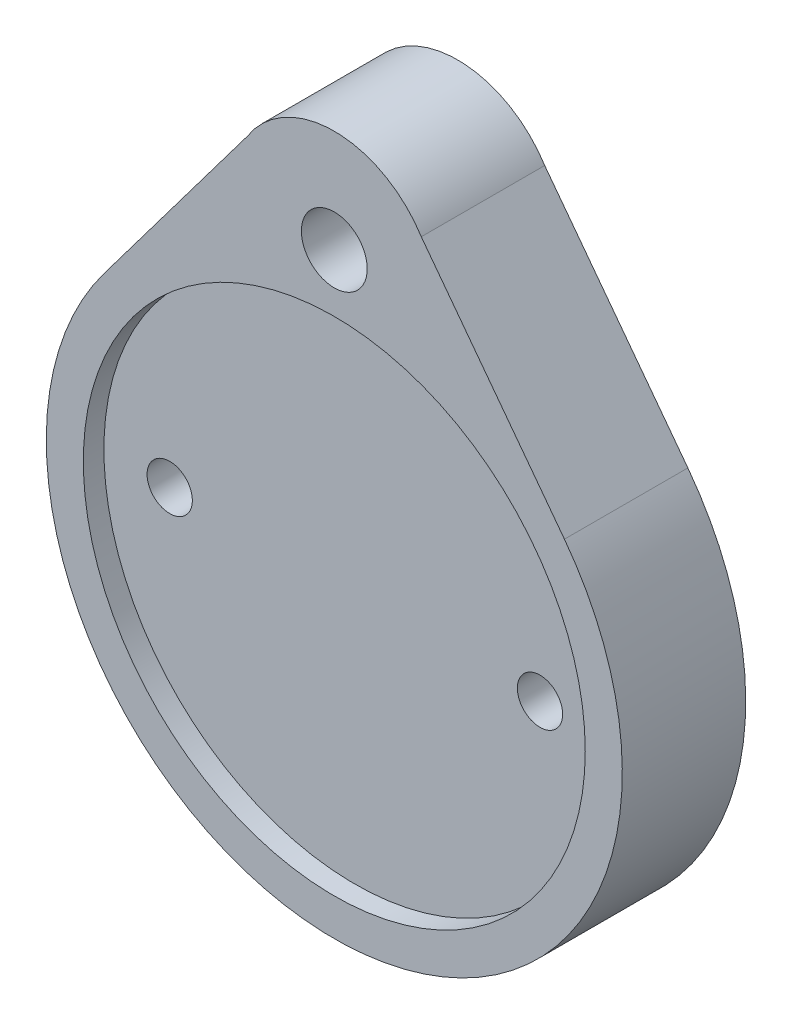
ISO-10303-21;
HEADER;
FILE_DESCRIPTION(('STEP AP214'),'2;1');
FILE_NAME('part.step','',(''),(''),'','','');
FILE_SCHEMA(('AUTOMOTIVE_DESIGN { 1 0 10303 214 1 1 1 1 }'));
ENDSEC;
DATA;
#1=APPLICATION_CONTEXT('core data for automotive mechanical design processes');
#2=APPLICATION_PROTOCOL_DEFINITION('international standard','automotive_design',2000,#1);
#3=PRODUCT_CONTEXT('',#1,'mechanical');
#4=PRODUCT('Part','Part','',(#3));
#5=PRODUCT_RELATED_PRODUCT_CATEGORY('part','',(#4));
#6=PRODUCT_DEFINITION_FORMATION('','',#4);
#7=PRODUCT_DEFINITION_CONTEXT('part definition',#1,'design');
#8=PRODUCT_DEFINITION('design','',#6,#7);
#9=PRODUCT_DEFINITION_SHAPE('','',#8);
#10=(LENGTH_UNIT() NAMED_UNIT(*) SI_UNIT(.MILLI.,.METRE.));
#11=(NAMED_UNIT(*) PLANE_ANGLE_UNIT() SI_UNIT($,.RADIAN.));
#12=(NAMED_UNIT(*) SI_UNIT($,.STERADIAN.) SOLID_ANGLE_UNIT());
#13=UNCERTAINTY_MEASURE_WITH_UNIT(LENGTH_MEASURE(1.E-05),#10,'distance_accuracy_value','');
#14=(GEOMETRIC_REPRESENTATION_CONTEXT(3) GLOBAL_UNCERTAINTY_ASSIGNED_CONTEXT((#13)) GLOBAL_UNIT_ASSIGNED_CONTEXT((#10,
#11,#12)) REPRESENTATION_CONTEXT('',''));
#15=CARTESIAN_POINT('',(0.,0.,0.));
#16=DIRECTION('',(0.,0.,1.));
#17=DIRECTION('',(1.,0.,0.));
#18=AXIS2_PLACEMENT_3D('',#15,#16,#17);
#19=CARTESIAN_POINT('',(0.,15.,6.));
#20=DIRECTION('',(0.,0.,1.));
#21=DIRECTION('',(1.,0.,0.));
#22=AXIS2_PLACEMENT_3D('',#19,#20,#21);
#23=PLANE('',#22);
#24=CARTESIAN_POINT('',(0.,0.,6.));
#25=DIRECTION('',(0.,0.,1.));
#26=DIRECTION('',(1.,0.,0.));
#27=AXIS2_PLACEMENT_3D('',#24,#25,#26);
#28=CIRCLE('',#27,12.2);
#29=CARTESIAN_POINT('',(12.2,0.,6.));
#30=VERTEX_POINT('',#29);
#31=EDGE_CURVE('E122',#30,#30,#28,.T.);
#32=ORIENTED_EDGE('',*,*,#31,.F.);
#33=EDGE_LOOP('',(#32));
#34=FACE_BOUND('',#33,.T.);
#35=CARTESIAN_POINT('',(0.,15.,6.));
#36=DIRECTION('',(0.,0.,1.));
#37=DIRECTION('',(1.,0.,0.));
#38=AXIS2_PLACEMENT_3D('',#35,#36,#37);
#39=CIRCLE('',#38,5.);
#40=CARTESIAN_POINT('',(4.2295258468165,17.6666666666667,6.));
#41=VERTEX_POINT('',#40);
#42=CARTESIAN_POINT('',(-4.2295258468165,17.6666666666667,6.));
#43=VERTEX_POINT('',#42);
#44=EDGE_CURVE('E89',#41,#43,#39,.T.);
#45=ORIENTED_EDGE('',*,*,#44,.T.);
#46=DIRECTION('',(-0.601130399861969,-0.799150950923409,0.));
#47=VECTOR('',#46,1.);
#48=CARTESIAN_POINT('',(-4.2295258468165,17.6666666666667,6.));
#49=LINE('',#48,#47);
#50=CARTESIAN_POINT('',(-11.1881133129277,8.41582559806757,6.));
#51=VERTEX_POINT('',#50);
#52=EDGE_CURVE('E84',#43,#51,#49,.T.);
#53=ORIENTED_EDGE('',*,*,#52,.T.);
#54=CARTESIAN_POINT('',(0.,0.,6.));
#55=DIRECTION('',(0.,0.,1.));
#56=DIRECTION('',(1.,0.,0.));
#57=AXIS2_PLACEMENT_3D('',#54,#55,#56);
#58=CIRCLE('',#57,14.);
#59=CARTESIAN_POINT('',(11.1881133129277,8.41582559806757,6.));
#60=VERTEX_POINT('',#59);
#61=EDGE_CURVE('E87',#51,#60,#58,.T.);
#62=ORIENTED_EDGE('',*,*,#61,.T.);
#63=DIRECTION('',(-0.601130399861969,0.799150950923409,0.));
#64=VECTOR('',#63,1.);
#65=CARTESIAN_POINT('',(4.2295258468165,17.6666666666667,6.));
#66=LINE('',#65,#64);
#67=EDGE_CURVE('E54',#60,#41,#66,.T.);
#68=ORIENTED_EDGE('',*,*,#67,.T.);
#69=EDGE_LOOP('',(#45,#53,#62,#68));
#70=FACE_BOUND('',#69,.T.);
#71=CARTESIAN_POINT('',(0.,15.,6.));
#72=DIRECTION('',(0.,0.,1.));
#73=DIRECTION('',(1.,0.,0.));
#74=AXIS2_PLACEMENT_3D('',#71,#72,#73);
#75=CIRCLE('',#74,1.6);
#76=CARTESIAN_POINT('',(1.6,15.,6.));
#77=VERTEX_POINT('',#76);
#78=EDGE_CURVE('E104',#77,#77,#75,.T.);
#79=ORIENTED_EDGE('',*,*,#78,.F.);
#80=EDGE_LOOP('',(#79));
#81=FACE_BOUND('',#80,.T.);
#82=ADVANCED_FACE('F37',(#34,#70,#81),#23,.T.);
#83=CARTESIAN_POINT('',(0.,15.,0.));
#84=DIRECTION('',(0.,0.,1.));
#85=DIRECTION('',(1.,0.,0.));
#86=AXIS2_PLACEMENT_3D('',#83,#84,#85);
#87=PLANE('',#86);
#88=CARTESIAN_POINT('',(0.,15.,0.));
#89=DIRECTION('',(0.,0.,1.));
#90=DIRECTION('',(1.,0.,0.));
#91=AXIS2_PLACEMENT_3D('',#88,#89,#90);
#92=CIRCLE('',#91,5.);
#93=CARTESIAN_POINT('',(4.2295258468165,17.6666666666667,0.));
#94=VERTEX_POINT('',#93);
#95=CARTESIAN_POINT('',(-4.2295258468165,17.6666666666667,0.));
#96=VERTEX_POINT('',#95);
#97=EDGE_CURVE('E101',#94,#96,#92,.T.);
#98=ORIENTED_EDGE('',*,*,#97,.F.);
#99=DIRECTION('',(-0.601130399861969,0.799150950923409,0.));
#100=VECTOR('',#99,1.);
#101=CARTESIAN_POINT('',(4.2295258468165,17.6666666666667,0.));
#102=LINE('',#101,#100);
#103=CARTESIAN_POINT('',(11.1881133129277,8.41582559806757,0.));
#104=VERTEX_POINT('',#103);
#105=EDGE_CURVE('E77',#104,#94,#102,.T.);
#106=ORIENTED_EDGE('',*,*,#105,.F.);
#107=CARTESIAN_POINT('',(0.,0.,0.));
#108=DIRECTION('',(0.,0.,1.));
#109=DIRECTION('',(1.,0.,0.));
#110=AXIS2_PLACEMENT_3D('',#107,#108,#109);
#111=CIRCLE('',#110,14.);
#112=CARTESIAN_POINT('',(-11.1881133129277,8.41582559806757,0.));
#113=VERTEX_POINT('',#112);
#114=EDGE_CURVE('E71',#113,#104,#111,.T.);
#115=ORIENTED_EDGE('',*,*,#114,.F.);
#116=DIRECTION('',(-0.601130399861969,-0.799150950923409,0.));
#117=VECTOR('',#116,1.);
#118=CARTESIAN_POINT('',(-4.2295258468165,17.6666666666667,0.));
#119=LINE('',#118,#117);
#120=EDGE_CURVE('E93',#96,#113,#119,.T.);
#121=ORIENTED_EDGE('',*,*,#120,.F.);
#122=EDGE_LOOP('',(#98,#106,#115,#121));
#123=FACE_BOUND('',#122,.T.);
#124=CARTESIAN_POINT('',(0.,15.,0.));
#125=DIRECTION('',(0.,0.,1.));
#126=DIRECTION('',(1.,0.,0.));
#127=AXIS2_PLACEMENT_3D('',#124,#125,#126);
#128=CIRCLE('',#127,1.6);
#129=CARTESIAN_POINT('',(1.6,15.,0.));
#130=VERTEX_POINT('',#129);
#131=EDGE_CURVE('E116',#130,#130,#128,.T.);
#132=ORIENTED_EDGE('',*,*,#131,.T.);
#133=EDGE_LOOP('',(#132));
#134=FACE_BOUND('',#133,.T.);
#135=ADVANCED_FACE('F112',(#123,#134),#87,.F.);
#136=CARTESIAN_POINT('',(0.,15.,6.));
#137=DIRECTION('',(0.,0.,-1.));
#138=DIRECTION('',(-1.,0.,0.));
#139=AXIS2_PLACEMENT_3D('',#136,#137,#138);
#140=CYLINDRICAL_SURFACE('',#139,5.);
#141=ORIENTED_EDGE('',*,*,#97,.T.);
#142=DIRECTION('',(0.,0.,-1.));
#143=VECTOR('',#142,1.);
#144=CARTESIAN_POINT('',(-4.2295258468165,17.6666666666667,6.));
#145=LINE('',#144,#143);
#146=EDGE_CURVE('E11',#43,#96,#145,.T.);
#147=ORIENTED_EDGE('',*,*,#146,.F.);
#148=ORIENTED_EDGE('',*,*,#44,.F.);
#149=DIRECTION('',(0.,0.,-1.));
#150=VECTOR('',#149,1.);
#151=CARTESIAN_POINT('',(4.2295258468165,17.6666666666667,6.));
#152=LINE('',#151,#150);
#153=EDGE_CURVE('E97',#41,#94,#152,.T.);
#154=ORIENTED_EDGE('',*,*,#153,.T.);
#155=EDGE_LOOP('',(#141,#147,#148,#154));
#156=FACE_BOUND('',#155,.T.);
#157=ADVANCED_FACE('F39',(#156),#140,.T.);
#158=CARTESIAN_POINT('',(-4.2295258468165,17.6666666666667,6.));
#159=DIRECTION('',(0.799150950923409,-0.601130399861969,0.));
#160=DIRECTION('',(0.601130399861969,0.799150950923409,0.));
#161=AXIS2_PLACEMENT_3D('',#158,#159,#160);
#162=PLANE('',#161);
#163=ORIENTED_EDGE('',*,*,#120,.T.);
#164=DIRECTION('',(0.,0.,-1.));
#165=VECTOR('',#164,1.);
#166=CARTESIAN_POINT('',(-11.1881133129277,8.41582559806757,6.));
#167=LINE('',#166,#165);
#168=EDGE_CURVE('E46',#51,#113,#167,.T.);
#169=ORIENTED_EDGE('',*,*,#168,.F.);
#170=ORIENTED_EDGE('',*,*,#52,.F.);
#171=ORIENTED_EDGE('',*,*,#146,.T.);
#172=EDGE_LOOP('',(#163,#169,#170,#171));
#173=FACE_BOUND('',#172,.T.);
#174=ADVANCED_FACE('F92',(#173),#162,.F.);
#175=CARTESIAN_POINT('',(0.,0.,6.));
#176=DIRECTION('',(0.,0.,-1.));
#177=DIRECTION('',(-1.,0.,0.));
#178=AXIS2_PLACEMENT_3D('',#175,#176,#177);
#179=CYLINDRICAL_SURFACE('',#178,14.);
#180=ORIENTED_EDGE('',*,*,#114,.T.);
#181=DIRECTION('',(0.,0.,-1.));
#182=VECTOR('',#181,1.);
#183=CARTESIAN_POINT('',(11.1881133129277,8.41582559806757,6.));
#184=LINE('',#183,#182);
#185=EDGE_CURVE('E94',#60,#104,#184,.T.);
#186=ORIENTED_EDGE('',*,*,#185,.F.);
#187=ORIENTED_EDGE('',*,*,#61,.F.);
#188=ORIENTED_EDGE('',*,*,#168,.T.);
#189=EDGE_LOOP('',(#180,#186,#187,#188));
#190=FACE_BOUND('',#189,.T.);
#191=ADVANCED_FACE('F95',(#190),#179,.T.);
#192=CARTESIAN_POINT('',(4.2295258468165,17.6666666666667,6.));
#193=DIRECTION('',(-0.799150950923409,-0.601130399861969,0.));
#194=DIRECTION('',(0.601130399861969,-0.799150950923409,0.));
#195=AXIS2_PLACEMENT_3D('',#192,#193,#194);
#196=PLANE('',#195);
#197=ORIENTED_EDGE('',*,*,#105,.T.);
#198=ORIENTED_EDGE('',*,*,#153,.F.);
#199=ORIENTED_EDGE('',*,*,#67,.F.);
#200=ORIENTED_EDGE('',*,*,#185,.T.);
#201=EDGE_LOOP('',(#197,#198,#199,#200));
#202=FACE_BOUND('',#201,.T.);
#203=ADVANCED_FACE('F109',(#202),#196,.F.);
#204=CARTESIAN_POINT('',(0.,15.,6.));
#205=DIRECTION('',(0.,0.,-1.));
#206=DIRECTION('',(-1.,0.,0.));
#207=AXIS2_PLACEMENT_3D('',#204,#205,#206);
#208=CYLINDRICAL_SURFACE('',#207,1.6);
#209=ORIENTED_EDGE('',*,*,#78,.T.);
#210=EDGE_LOOP('',(#209));
#211=FACE_BOUND('',#210,.T.);
#212=ORIENTED_EDGE('',*,*,#131,.F.);
#213=EDGE_LOOP('',(#212));
#214=FACE_BOUND('',#213,.T.);
#215=ADVANCED_FACE('F161',(#211,#214),#208,.F.);
#216=CARTESIAN_POINT('',(0.,0.,5.));
#217=DIRECTION('',(0.,0.,1.));
#218=DIRECTION('',(1.,0.,0.));
#219=AXIS2_PLACEMENT_3D('',#216,#217,#218);
#220=CYLINDRICAL_SURFACE('',#219,12.2);
#221=CARTESIAN_POINT('',(0.,0.,5.));
#222=DIRECTION('',(0.,0.,1.));
#223=DIRECTION('',(1.,0.,0.));
#224=AXIS2_PLACEMENT_3D('',#221,#222,#223);
#225=CIRCLE('',#224,12.2);
#226=CARTESIAN_POINT('',(12.2,0.,5.));
#227=VERTEX_POINT('',#226);
#228=EDGE_CURVE('E119',#227,#227,#225,.T.);
#229=ORIENTED_EDGE('',*,*,#228,.F.);
#230=EDGE_LOOP('',(#229));
#231=FACE_BOUND('',#230,.T.);
#232=ORIENTED_EDGE('',*,*,#31,.T.);
#233=EDGE_LOOP('',(#232));
#234=FACE_BOUND('',#233,.T.);
#235=ADVANCED_FACE('F153',(#231,#234),#220,.F.);
#236=CARTESIAN_POINT('',(0.,0.,5.));
#237=DIRECTION('',(0.,0.,1.));
#238=DIRECTION('',(1.,0.,0.));
#239=AXIS2_PLACEMENT_3D('',#236,#237,#238);
#240=PLANE('',#239);
#241=CARTESIAN_POINT('',(-9.,0.,5.));
#242=DIRECTION('',(0.,0.,1.));
#243=DIRECTION('',(-1.,0.,0.));
#244=AXIS2_PLACEMENT_3D('',#241,#242,#243);
#245=CIRCLE('',#244,1.1);
#246=CARTESIAN_POINT('',(-10.1,0.,5.));
#247=VERTEX_POINT('',#246);
#248=EDGE_CURVE('E134',#247,#247,#245,.T.);
#249=ORIENTED_EDGE('',*,*,#248,.F.);
#250=EDGE_LOOP('',(#249));
#251=FACE_BOUND('',#250,.T.);
#252=CARTESIAN_POINT('',(9.,0.,5.));
#253=DIRECTION('',(0.,0.,1.));
#254=DIRECTION('',(1.,0.,0.));
#255=AXIS2_PLACEMENT_3D('',#252,#253,#254);
#256=CIRCLE('',#255,1.1);
#257=CARTESIAN_POINT('',(10.1,0.,5.));
#258=VERTEX_POINT('',#257);
#259=EDGE_CURVE('E128',#258,#258,#256,.T.);
#260=ORIENTED_EDGE('',*,*,#259,.F.);
#261=EDGE_LOOP('',(#260));
#262=FACE_BOUND('',#261,.T.);
#263=ORIENTED_EDGE('',*,*,#228,.T.);
#264=EDGE_LOOP('',(#263));
#265=FACE_BOUND('',#264,.T.);
#266=ADVANCED_FACE('F149',(#251,#262,#265),#240,.T.);
#267=CARTESIAN_POINT('',(9.,0.,3.));
#268=DIRECTION('',(0.,0.,1.));
#269=DIRECTION('',(1.,0.,0.));
#270=AXIS2_PLACEMENT_3D('',#267,#268,#269);
#271=CYLINDRICAL_SURFACE('',#270,1.1);
#272=CARTESIAN_POINT('',(9.,0.,3.));
#273=DIRECTION('',(0.,0.,1.));
#274=DIRECTION('',(1.,0.,0.));
#275=AXIS2_PLACEMENT_3D('',#272,#273,#274);
#276=CIRCLE('',#275,1.1);
#277=CARTESIAN_POINT('',(10.1,0.,3.));
#278=VERTEX_POINT('',#277);
#279=EDGE_CURVE('E125',#278,#278,#276,.T.);
#280=ORIENTED_EDGE('',*,*,#279,.F.);
#281=EDGE_LOOP('',(#280));
#282=FACE_BOUND('',#281,.T.);
#283=ORIENTED_EDGE('',*,*,#259,.T.);
#284=EDGE_LOOP('',(#283));
#285=FACE_BOUND('',#284,.T.);
#286=ADVANCED_FACE('F152',(#282,#285),#271,.F.);
#287=CARTESIAN_POINT('',(9.,0.,3.));
#288=DIRECTION('',(0.,0.,1.));
#289=DIRECTION('',(1.,0.,0.));
#290=AXIS2_PLACEMENT_3D('',#287,#288,#289);
#291=PLANE('',#290);
#292=ORIENTED_EDGE('',*,*,#279,.T.);
#293=EDGE_LOOP('',(#292));
#294=FACE_BOUND('',#293,.T.);
#295=ADVANCED_FACE('F145',(#294),#291,.T.);
#296=CARTESIAN_POINT('',(-9.,0.,3.));
#297=DIRECTION('',(0.,0.,1.));
#298=DIRECTION('',(1.,0.,0.));
#299=AXIS2_PLACEMENT_3D('',#296,#297,#298);
#300=CYLINDRICAL_SURFACE('',#299,1.1);
#301=CARTESIAN_POINT('',(-9.,0.,3.));
#302=DIRECTION('',(0.,0.,1.));
#303=DIRECTION('',(-1.,0.,0.));
#304=AXIS2_PLACEMENT_3D('',#301,#302,#303);
#305=CIRCLE('',#304,1.1);
#306=CARTESIAN_POINT('',(-10.1,0.,3.));
#307=VERTEX_POINT('',#306);
#308=EDGE_CURVE('E131',#307,#307,#305,.T.);
#309=ORIENTED_EDGE('',*,*,#308,.F.);
#310=EDGE_LOOP('',(#309));
#311=FACE_BOUND('',#310,.T.);
#312=ORIENTED_EDGE('',*,*,#248,.T.);
#313=EDGE_LOOP('',(#312));
#314=FACE_BOUND('',#313,.T.);
#315=ADVANCED_FACE('F142',(#311,#314),#300,.F.);
#316=CARTESIAN_POINT('',(-9.,0.,3.));
#317=DIRECTION('',(0.,0.,-1.));
#318=DIRECTION('',(-1.,0.,0.));
#319=AXIS2_PLACEMENT_3D('',#316,#317,#318);
#320=PLANE('',#319);
#321=ORIENTED_EDGE('',*,*,#308,.T.);
#322=EDGE_LOOP('',(#321));
#323=FACE_BOUND('',#322,.T.);
#324=ADVANCED_FACE('F140',(#323),#320,.F.);
#325=CLOSED_SHELL('',(#82,#135,#157,#174,#191,#203,#215,#235,#266,#286,#295,#315,#324));
#326=MANIFOLD_SOLID_BREP('B2',#325);
#327=ADVANCED_BREP_SHAPE_REPRESENTATION('',(#18,#326),#14);
#328=SHAPE_DEFINITION_REPRESENTATION(#9,#327);
ENDSEC;
END-ISO-10303-21;
